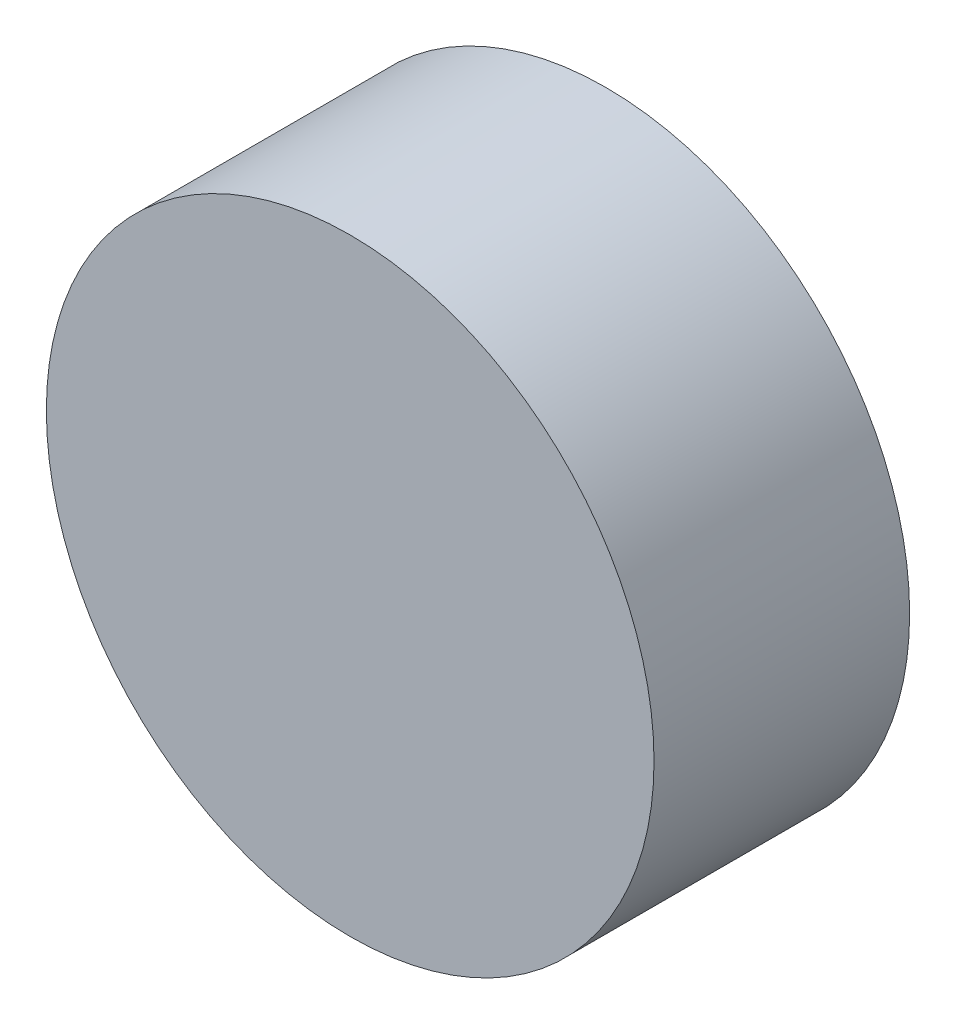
ISO-10303-21;
HEADER;
FILE_DESCRIPTION(('STEP AP214'),'2;1');
FILE_NAME('part.step','',(''),(''),'','','');
FILE_SCHEMA(('AUTOMOTIVE_DESIGN { 1 0 10303 214 1 1 1 1 }'));
ENDSEC;
DATA;
#1=APPLICATION_CONTEXT('core data for automotive mechanical design processes');
#2=APPLICATION_PROTOCOL_DEFINITION('international standard','automotive_design',2000,#1);
#3=PRODUCT_CONTEXT('',#1,'mechanical');
#4=PRODUCT('Part','Part','',(#3));
#5=PRODUCT_RELATED_PRODUCT_CATEGORY('part','',(#4));
#6=PRODUCT_DEFINITION_FORMATION('','',#4);
#7=PRODUCT_DEFINITION_CONTEXT('part definition',#1,'design');
#8=PRODUCT_DEFINITION('design','',#6,#7);
#9=PRODUCT_DEFINITION_SHAPE('','',#8);
#10=(LENGTH_UNIT() NAMED_UNIT(*) SI_UNIT(.MILLI.,.METRE.));
#11=(NAMED_UNIT(*) PLANE_ANGLE_UNIT() SI_UNIT($,.RADIAN.));
#12=(NAMED_UNIT(*) SI_UNIT($,.STERADIAN.) SOLID_ANGLE_UNIT());
#13=UNCERTAINTY_MEASURE_WITH_UNIT(LENGTH_MEASURE(1.E-05),#10,'distance_accuracy_value','');
#14=(GEOMETRIC_REPRESENTATION_CONTEXT(3) GLOBAL_UNCERTAINTY_ASSIGNED_CONTEXT((#13)) GLOBAL_UNIT_ASSIGNED_CONTEXT((#10,
#11,#12)) REPRESENTATION_CONTEXT('',''));
#15=CARTESIAN_POINT('',(0.,0.,0.));
#16=DIRECTION('',(0.,0.,1.));
#17=DIRECTION('',(1.,0.,0.));
#18=AXIS2_PLACEMENT_3D('',#15,#16,#17);
#19=CARTESIAN_POINT('',(0.,0.,26.924));
#20=DIRECTION('',(0.,0.,-1.));
#21=DIRECTION('',(-1.,0.,0.));
#22=AXIS2_PLACEMENT_3D('',#19,#20,#21);
#23=CYLINDRICAL_SURFACE('',#22,32.004);
#24=CARTESIAN_POINT('',(0.,0.,26.924));
#25=DIRECTION('',(0.,0.,1.));
#26=DIRECTION('',(1.,0.,0.));
#27=AXIS2_PLACEMENT_3D('',#24,#25,#26);
#28=CIRCLE('',#27,32.004);
#29=CARTESIAN_POINT('',(32.004,0.,26.924));
#30=VERTEX_POINT('',#29);
#31=EDGE_CURVE('E10',#30,#30,#28,.T.);
#32=ORIENTED_EDGE('',*,*,#31,.F.);
#33=EDGE_LOOP('',(#32));
#34=FACE_BOUND('',#33,.T.);
#35=CARTESIAN_POINT('',(0.,0.,0.));
#36=DIRECTION('',(0.,0.,1.));
#37=DIRECTION('',(1.,0.,0.));
#38=AXIS2_PLACEMENT_3D('',#35,#36,#37);
#39=CIRCLE('',#38,32.004);
#40=CARTESIAN_POINT('',(32.004,0.,0.));
#41=VERTEX_POINT('',#40);
#42=EDGE_CURVE('E34',#41,#41,#39,.T.);
#43=ORIENTED_EDGE('',*,*,#42,.T.);
#44=EDGE_LOOP('',(#43));
#45=FACE_BOUND('',#44,.T.);
#46=ADVANCED_FACE('F31',(#34,#45),#23,.T.);
#47=CARTESIAN_POINT('',(0.,0.,26.924));
#48=DIRECTION('',(0.,0.,1.));
#49=DIRECTION('',(1.,0.,0.));
#50=AXIS2_PLACEMENT_3D('',#47,#48,#49);
#51=PLANE('',#50);
#52=ORIENTED_EDGE('',*,*,#31,.T.);
#53=EDGE_LOOP('',(#52));
#54=FACE_BOUND('',#53,.T.);
#55=ADVANCED_FACE('F46',(#54),#51,.T.);
#56=CARTESIAN_POINT('',(0.,0.,0.));
#57=DIRECTION('',(0.,0.,1.));
#58=DIRECTION('',(1.,0.,0.));
#59=AXIS2_PLACEMENT_3D('',#56,#57,#58);
#60=PLANE('',#59);
#61=ORIENTED_EDGE('',*,*,#42,.F.);
#62=EDGE_LOOP('',(#61));
#63=FACE_BOUND('',#62,.T.);
#64=ADVANCED_FACE('F44',(#63),#60,.F.);
#65=CLOSED_SHELL('',(#46,#55,#64));
#66=MANIFOLD_SOLID_BREP('B2',#65);
#67=ADVANCED_BREP_SHAPE_REPRESENTATION('',(#18,#66),#14);
#68=SHAPE_DEFINITION_REPRESENTATION(#9,#67);
ENDSEC;
END-ISO-10303-21;
